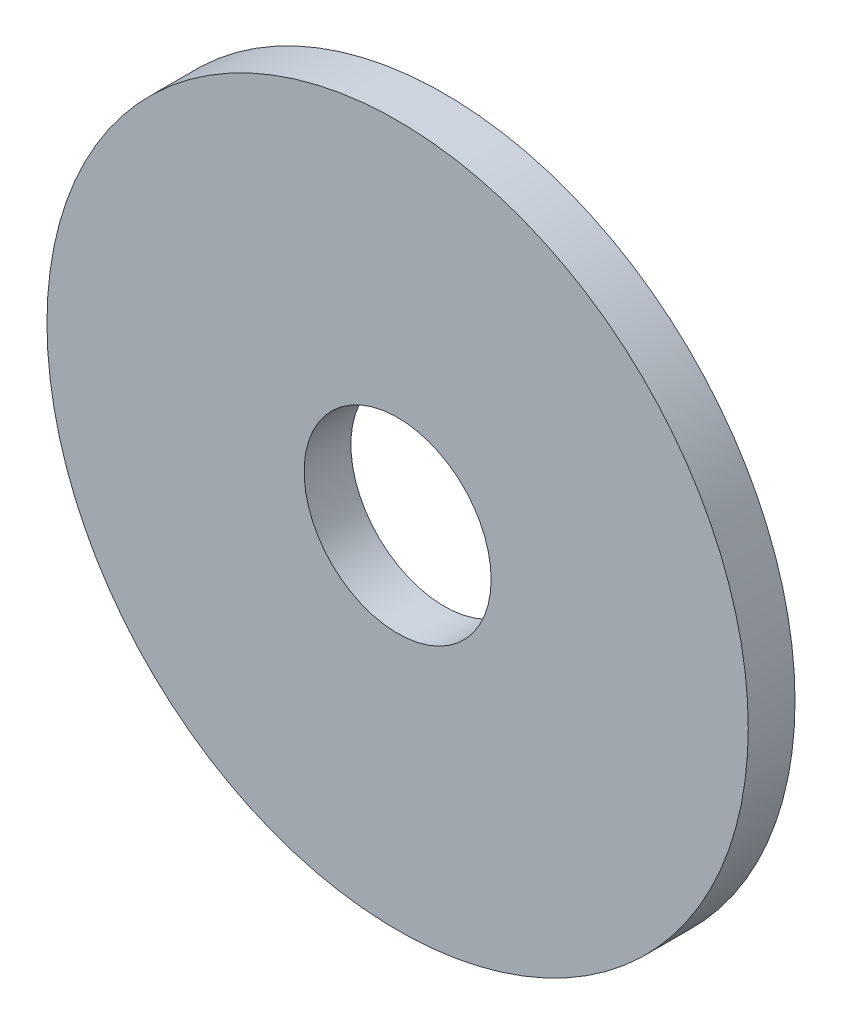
from build123d import *

# Parameters (mm, degrees)
ESQUISSE1_R      = 6
ESQUISSE1_R_2    = 1.6
EXTRUSION1_DEPTH = 0.8


with BuildPart() as part:
    # Esquisse1 → Extrusion1 (new body)
    with BuildSketch(Plane.XY):
        Circle(ESQUISSE1_R)
        Circle(ESQUISSE1_R_2, mode=Mode.SUBTRACT)
    extrude(amount=EXTRUSION1_DEPTH)


solid = part.part
